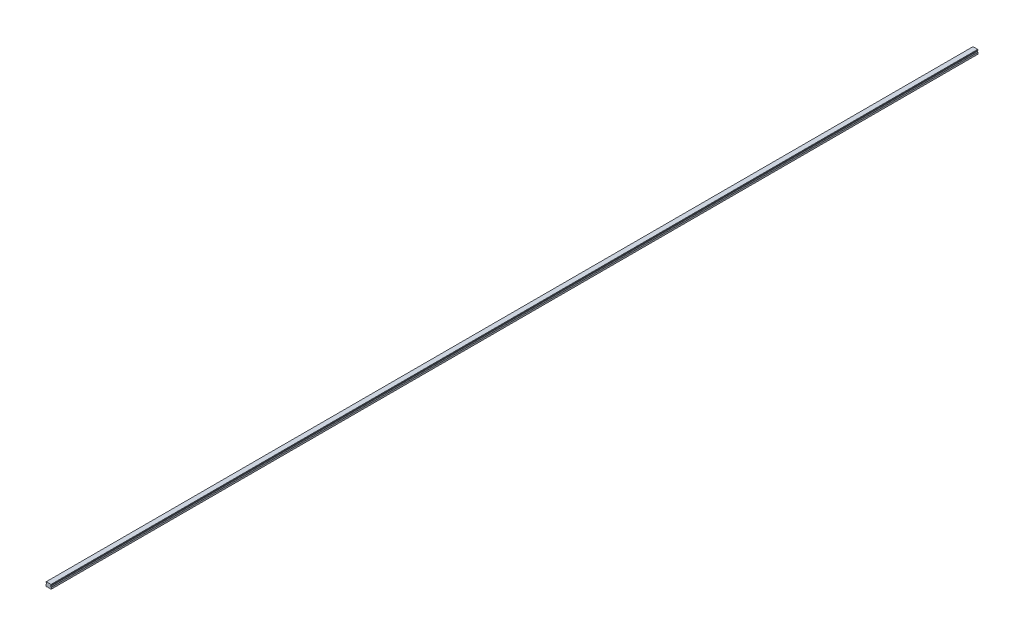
from build123d import *

# Parameters (mm, degrees)
SKETCH1_W           = 20
SKETCH1_H           = 16.3
BOSS_EXTRUDE1_DEPTH = 1760
CUT_EXTRUDE1_DEPTH  = 3521.051944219
CHAMFER1_SIZE       = 1
FILLET1_R           = 1
CUT_EXTRUDE2_DEPTH  = 3521.051944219
SKETCH5_R           = 3
SKETCH5_R_2         = 2.5
CUT_EXTRUDE5_DEPTH  = 10
SKETCH5_2_R         = 2.5
CUT_EXTRUDE6_DEPTH  = 13
LPATTERN2_COUNT     = 59
LPATTERN2_PITCH     = 60


with BuildPart() as part:
    # Sketch1 → Boss-Extrude1 (new, symmetric)
    with BuildSketch(Plane.XY):
        with Locations((0, 8.15)):
            Rectangle(SKETCH1_W, SKETCH1_H)
    extrude(amount=BOSS_EXTRUDE1_DEPTH, both=True)

    # Sketch2 → Cut-Extrude1 (cut, through all)
    with BuildSketch(Plane.XY.offset(1760)):
        Polygon((-10, 14.3), (-10, 7.3), (-7.666666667, 9.633333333), (-7.666666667, 11.966666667), align=None)
        Polygon((7.666666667, 11.966666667), (10, 14.3), (10, 7.3), (7.666666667, 9.633333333), align=None)
    extrude(amount=-CUT_EXTRUDE1_DEPTH, mode=Mode.SUBTRACT)

    # Chamfer1
    chamfer1_edges = [part.edges().sort_by_distance(p)[0] for p in [
        (-10, 16.3, 0),
        (10, 16.3, 0),
        (10, 0, 0),
        (-10, 0, 0),
    ]]
    chamfer(chamfer1_edges, length=CHAMFER1_SIZE)

    # Fillet1
    fillet1_edges = [part.edges().sort_by_distance(p)[0] for p in [
        (-7.666666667, 11.966666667, 0),
        (-7.666666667, 9.633333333, 0),
        (7.666666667, 9.633333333, 0),
        (7.666666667, 11.966666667, 0),
    ]]
    fillet(fillet1_edges, radius=FILLET1_R)

    # Sketch3 → Cut-Extrude2 (cut, through all)
    with BuildSketch(Plane.XY.offset(1760)):
        Polygon((-6, 0), (-5, 1), (5, 1), (6, 0), align=None)
    extrude(amount=-CUT_EXTRUDE2_DEPTH, mode=Mode.SUBTRACT)

    # Sketch5 → Cut-Extrude5 (cut)
    with BuildSketch(Plane.XZ.offset(-1)):
        with Locations(Location((0, 1740, 0), (0, 0, 270))):
            Circle(SKETCH5_R)
        with Locations(Location((0, 1740, 0), (0, 0, 270))):
            Circle(SKETCH5_R_2, mode=Mode.SUBTRACT)
    cut_extrude5 = extrude(amount=-CUT_EXTRUDE5_DEPTH, mode=Mode.SUBTRACT)

    # Sketch5_2 → Cut-Extrude6 (cut)
    with BuildSketch(Plane.XZ.offset(-1)):
        with Locations(Location((0, 1740, 0), (0, 0, 270))):
            Circle(SKETCH5_2_R)
    cut_extrude6 = extrude(amount=-CUT_EXTRUDE6_DEPTH, mode=Mode.SUBTRACT)

    # Cut-Extrude7 cone 1 section (on through the dimple's axis) → Cut-Extrude7 (revolve, cut)
    with BuildSketch(Plane(origin=(0, 14, 1740), x_dir=(0, 0, -1), z_dir=(1, 0, 0))):
        Polygon((0, 0), (2.5, 0), (0, 1.443375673), align=None)
    cut_extrude7 = revolve(axis=Axis((0, 14, 1740), (0, 1, 0)), mode=Mode.SUBTRACT)

    # LPattern2: Cut-Extrude5, Cut-Extrude6, Cut-Extrude7 ×59
    with Locations(*[(0, 0, -i * LPATTERN2_PITCH) for i in range(1, LPATTERN2_COUNT)]):
        add(cut_extrude5, mode=Mode.SUBTRACT)
        add(cut_extrude6, mode=Mode.SUBTRACT)
        add(cut_extrude7, mode=Mode.SUBTRACT)


solid = part.part
